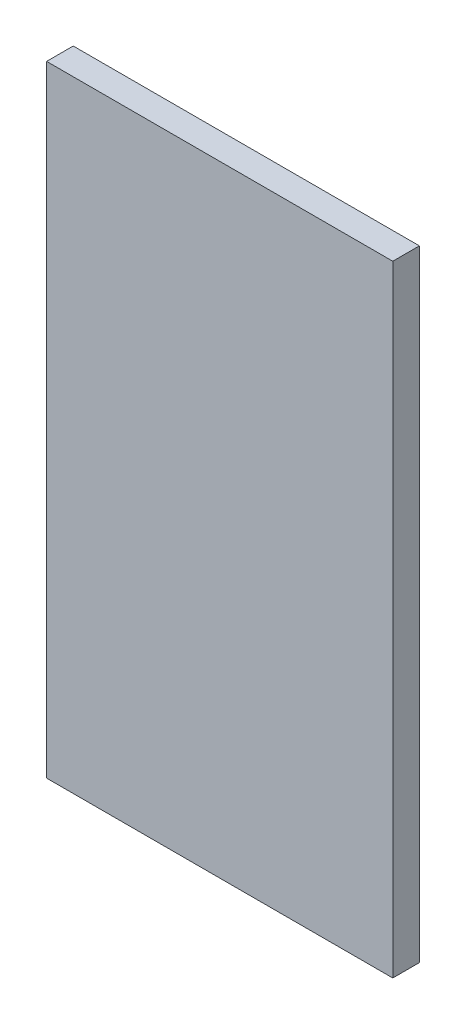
ISO-10303-21;
HEADER;
FILE_DESCRIPTION(('STEP AP214'),'2;1');
FILE_NAME('part.step','',(''),(''),'','','');
FILE_SCHEMA(('AUTOMOTIVE_DESIGN { 1 0 10303 214 1 1 1 1 }'));
ENDSEC;
DATA;
#1=APPLICATION_CONTEXT('core data for automotive mechanical design processes');
#2=APPLICATION_PROTOCOL_DEFINITION('international standard','automotive_design',2000,#1);
#3=PRODUCT_CONTEXT('',#1,'mechanical');
#4=PRODUCT('Part','Part','',(#3));
#5=PRODUCT_RELATED_PRODUCT_CATEGORY('part','',(#4));
#6=PRODUCT_DEFINITION_FORMATION('','',#4);
#7=PRODUCT_DEFINITION_CONTEXT('part definition',#1,'design');
#8=PRODUCT_DEFINITION('design','',#6,#7);
#9=PRODUCT_DEFINITION_SHAPE('','',#8);
#10=(LENGTH_UNIT() NAMED_UNIT(*) SI_UNIT(.MILLI.,.METRE.));
#11=(NAMED_UNIT(*) PLANE_ANGLE_UNIT() SI_UNIT($,.RADIAN.));
#12=(NAMED_UNIT(*) SI_UNIT($,.STERADIAN.) SOLID_ANGLE_UNIT());
#13=UNCERTAINTY_MEASURE_WITH_UNIT(LENGTH_MEASURE(1.E-05),#10,'distance_accuracy_value','');
#14=(GEOMETRIC_REPRESENTATION_CONTEXT(3) GLOBAL_UNCERTAINTY_ASSIGNED_CONTEXT((#13)) GLOBAL_UNIT_ASSIGNED_CONTEXT((#10,
#11,#12)) REPRESENTATION_CONTEXT('',''));
#15=CARTESIAN_POINT('',(0.,0.,0.));
#16=DIRECTION('',(0.,0.,1.));
#17=DIRECTION('',(1.,0.,0.));
#18=AXIS2_PLACEMENT_3D('',#15,#16,#17);
#19=CARTESIAN_POINT('',(0.,0.,16.));
#20=DIRECTION('',(1.,0.,0.));
#21=DIRECTION('',(0.,1.,0.));
#22=AXIS2_PLACEMENT_3D('',#19,#20,#21);
#23=PLANE('',#22);
#24=DIRECTION('',(0.,-1.,0.));
#25=VECTOR('',#24,1.);
#26=CARTESIAN_POINT('',(0.,0.,0.));
#27=LINE('',#26,#25);
#28=CARTESIAN_POINT('',(0.,0.,0.));
#29=VERTEX_POINT('',#28);
#30=CARTESIAN_POINT('',(0.,-373.,0.));
#31=VERTEX_POINT('',#30);
#32=EDGE_CURVE('E94',#29,#31,#27,.T.);
#33=ORIENTED_EDGE('',*,*,#32,.T.);
#34=DIRECTION('',(0.,0.,-1.));
#35=VECTOR('',#34,1.);
#36=CARTESIAN_POINT('',(0.,-373.,16.));
#37=LINE('',#36,#35);
#38=CARTESIAN_POINT('',(0.,-373.,16.));
#39=VERTEX_POINT('',#38);
#40=EDGE_CURVE('E11',#39,#31,#37,.T.);
#41=ORIENTED_EDGE('',*,*,#40,.F.);
#42=DIRECTION('',(0.,-1.,0.));
#43=VECTOR('',#42,1.);
#44=CARTESIAN_POINT('',(0.,0.,16.));
#45=LINE('',#44,#43);
#46=CARTESIAN_POINT('',(0.,0.,16.));
#47=VERTEX_POINT('',#46);
#48=EDGE_CURVE('E82',#47,#39,#45,.T.);
#49=ORIENTED_EDGE('',*,*,#48,.F.);
#50=DIRECTION('',(0.,0.,-1.));
#51=VECTOR('',#50,1.);
#52=CARTESIAN_POINT('',(0.,0.,16.));
#53=LINE('',#52,#51);
#54=EDGE_CURVE('E90',#47,#29,#53,.T.);
#55=ORIENTED_EDGE('',*,*,#54,.T.);
#56=EDGE_LOOP('',(#33,#41,#49,#55));
#57=FACE_BOUND('',#56,.T.);
#58=ADVANCED_FACE('F31',(#57),#23,.F.);
#59=CARTESIAN_POINT('',(0.,-373.,16.));
#60=DIRECTION('',(0.,1.,0.));
#61=DIRECTION('',(0.,0.,1.));
#62=AXIS2_PLACEMENT_3D('',#59,#60,#61);
#63=PLANE('',#62);
#64=DIRECTION('',(1.,0.,0.));
#65=VECTOR('',#64,1.);
#66=CARTESIAN_POINT('',(0.,-373.,0.));
#67=LINE('',#66,#65);
#68=CARTESIAN_POINT('',(208.,-373.,0.));
#69=VERTEX_POINT('',#68);
#70=EDGE_CURVE('E86',#31,#69,#67,.T.);
#71=ORIENTED_EDGE('',*,*,#70,.T.);
#72=DIRECTION('',(0.,0.,-1.));
#73=VECTOR('',#72,1.);
#74=CARTESIAN_POINT('',(208.,-373.,16.));
#75=LINE('',#74,#73);
#76=CARTESIAN_POINT('',(208.,-373.,16.));
#77=VERTEX_POINT('',#76);
#78=EDGE_CURVE('E39',#77,#69,#75,.T.);
#79=ORIENTED_EDGE('',*,*,#78,.F.);
#80=DIRECTION('',(1.,0.,0.));
#81=VECTOR('',#80,1.);
#82=CARTESIAN_POINT('',(0.,-373.,16.));
#83=LINE('',#82,#81);
#84=EDGE_CURVE('E77',#39,#77,#83,.T.);
#85=ORIENTED_EDGE('',*,*,#84,.F.);
#86=ORIENTED_EDGE('',*,*,#40,.T.);
#87=EDGE_LOOP('',(#71,#79,#85,#86));
#88=FACE_BOUND('',#87,.T.);
#89=ADVANCED_FACE('F85',(#88),#63,.F.);
#90=CARTESIAN_POINT('',(208.,0.,16.));
#91=DIRECTION('',(-1.,0.,0.));
#92=DIRECTION('',(0.,-1.,0.));
#93=AXIS2_PLACEMENT_3D('',#90,#91,#92);
#94=PLANE('',#93);
#95=DIRECTION('',(0.,1.,0.));
#96=VECTOR('',#95,1.);
#97=CARTESIAN_POINT('',(208.,0.,0.));
#98=LINE('',#97,#96);
#99=CARTESIAN_POINT('',(208.,0.,0.));
#100=VERTEX_POINT('',#99);
#101=EDGE_CURVE('E64',#69,#100,#98,.T.);
#102=ORIENTED_EDGE('',*,*,#101,.T.);
#103=DIRECTION('',(0.,0.,-1.));
#104=VECTOR('',#103,1.);
#105=CARTESIAN_POINT('',(208.,0.,16.));
#106=LINE('',#105,#104);
#107=CARTESIAN_POINT('',(208.,0.,16.));
#108=VERTEX_POINT('',#107);
#109=EDGE_CURVE('E87',#108,#100,#106,.T.);
#110=ORIENTED_EDGE('',*,*,#109,.F.);
#111=DIRECTION('',(0.,1.,0.));
#112=VECTOR('',#111,1.);
#113=CARTESIAN_POINT('',(208.,0.,16.));
#114=LINE('',#113,#112);
#115=EDGE_CURVE('E80',#77,#108,#114,.T.);
#116=ORIENTED_EDGE('',*,*,#115,.F.);
#117=ORIENTED_EDGE('',*,*,#78,.T.);
#118=EDGE_LOOP('',(#102,#110,#116,#117));
#119=FACE_BOUND('',#118,.T.);
#120=ADVANCED_FACE('F88',(#119),#94,.F.);
#121=CARTESIAN_POINT('',(0.,0.,16.));
#122=DIRECTION('',(0.,-1.,0.));
#123=DIRECTION('',(0.,0.,-1.));
#124=AXIS2_PLACEMENT_3D('',#121,#122,#123);
#125=PLANE('',#124);
#126=DIRECTION('',(-1.,0.,0.));
#127=VECTOR('',#126,1.);
#128=CARTESIAN_POINT('',(0.,0.,0.));
#129=LINE('',#128,#127);
#130=EDGE_CURVE('E70',#100,#29,#129,.T.);
#131=ORIENTED_EDGE('',*,*,#130,.T.);
#132=ORIENTED_EDGE('',*,*,#54,.F.);
#133=DIRECTION('',(-1.,0.,0.));
#134=VECTOR('',#133,1.);
#135=CARTESIAN_POINT('',(0.,0.,16.));
#136=LINE('',#135,#134);
#137=EDGE_CURVE('E47',#108,#47,#136,.T.);
#138=ORIENTED_EDGE('',*,*,#137,.F.);
#139=ORIENTED_EDGE('',*,*,#109,.T.);
#140=EDGE_LOOP('',(#131,#132,#138,#139));
#141=FACE_BOUND('',#140,.T.);
#142=ADVANCED_FACE('F101',(#141),#125,.F.);
#143=CARTESIAN_POINT('',(0.,-373.,16.));
#144=DIRECTION('',(0.,0.,1.));
#145=DIRECTION('',(1.,0.,0.));
#146=AXIS2_PLACEMENT_3D('',#143,#144,#145);
#147=PLANE('',#146);
#148=ORIENTED_EDGE('',*,*,#48,.T.);
#149=ORIENTED_EDGE('',*,*,#84,.T.);
#150=ORIENTED_EDGE('',*,*,#115,.T.);
#151=ORIENTED_EDGE('',*,*,#137,.T.);
#152=EDGE_LOOP('',(#148,#149,#150,#151));
#153=FACE_BOUND('',#152,.T.);
#154=ADVANCED_FACE('F78',(#153),#147,.T.);
#155=CARTESIAN_POINT('',(0.,-373.,0.));
#156=DIRECTION('',(0.,0.,1.));
#157=DIRECTION('',(1.,0.,0.));
#158=AXIS2_PLACEMENT_3D('',#155,#156,#157);
#159=PLANE('',#158);
#160=ORIENTED_EDGE('',*,*,#32,.F.);
#161=ORIENTED_EDGE('',*,*,#130,.F.);
#162=ORIENTED_EDGE('',*,*,#101,.F.);
#163=ORIENTED_EDGE('',*,*,#70,.F.);
#164=EDGE_LOOP('',(#160,#161,#162,#163));
#165=FACE_BOUND('',#164,.T.);
#166=ADVANCED_FACE('F104',(#165),#159,.F.);
#167=CLOSED_SHELL('',(#58,#89,#120,#142,#154,#166));
#168=MANIFOLD_SOLID_BREP('B2',#167);
#169=ADVANCED_BREP_SHAPE_REPRESENTATION('',(#18,#168),#14);
#170=SHAPE_DEFINITION_REPRESENTATION(#9,#169);
ENDSEC;
END-ISO-10303-21;
